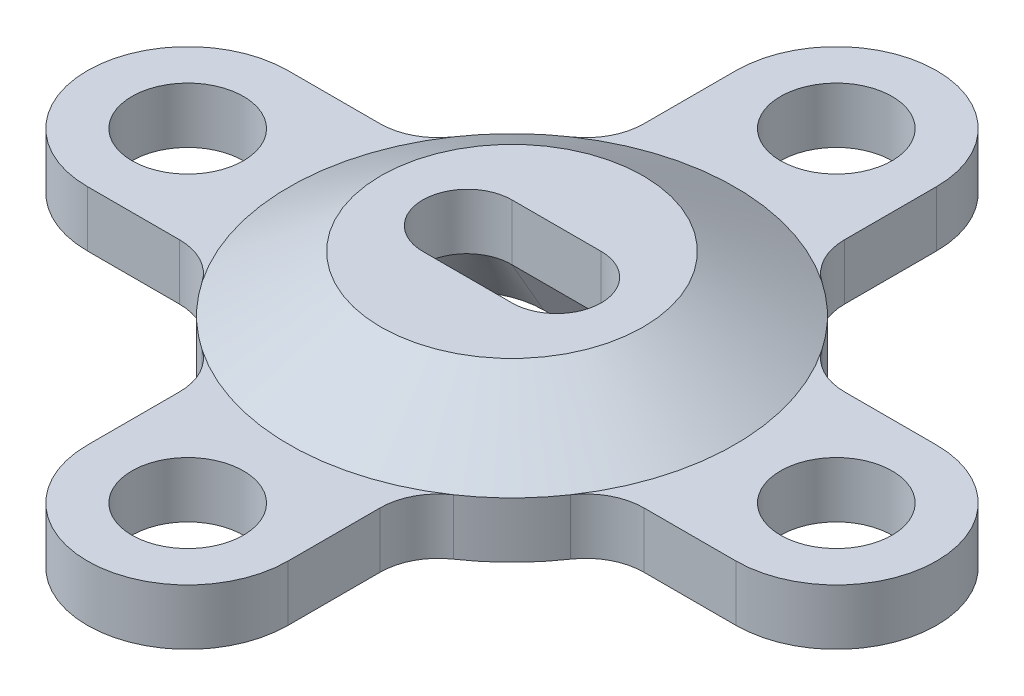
from build123d import *

# Parameters (mm, degrees)
CUT_EXTRUDE1_DEPTH  = 15.748
SKETCH3_R           = 3.175
BOSS_EXTRUDE1_DEPTH = 3.175
FILLET1_R           = 3.302
CUT_EXTRUDE2_DEPTH  = 3.175
CUT_EXTRUDE2_DRAFT  = -30


with BuildPart() as part:
    # Sketch1 → Revolve1 (revolve)
    with BuildSketch(Plane.XY, mode=Mode.PRIVATE) as revolve1_sk:
        Polygon((-12.7, 0), (-12.7, 3.175), (-7.465676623, 6.35), (0, 6.35), (0, 0), align=None)
    revolve(revolve1_sk.sketch.rotate(Axis((0, 0, 0), (0, -1, 0)), 270), axis=Axis((0, 0, 0), (0, -1, 0)))

    # Sketch2 → Cut-Extrude1 (cut)
    with BuildSketch(Plane(origin=(0, 6.35, 0), x_dir=(1, 0, 0), z_dir=(0, 1, 0))):
        with BuildLine():
            Line((-2.54, 2.54), (2.54, 2.54))
            ThreePointArc((2.54, 2.54), (5.08, 0), (2.54, -2.54))
            Line((2.54, -2.54), (-2.54, -2.54))
            ThreePointArc((-2.54, -2.54), (-5.08, 0), (-2.54, 2.54))
        make_face()
    extrude(amount=-CUT_EXTRUDE1_DEPTH, mode=Mode.SUBTRACT)

    # Sketch3 → Boss-Extrude1 (add)
    # profile 1 of 4: a face of its own
    with BuildSketch(Plane(origin=(0, 0, 0), x_dir=(1, 0, 0), z_dir=(0, 1, 0))):
        with BuildLine():
            Line((-5.715, 18.463010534), (-5.715, 7.915661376))
            Line((-5.715, 7.915661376), (5.715, 7.915661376))
            Line((5.715, 7.915661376), (5.715, 18.463010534))
            ThreePointArc((5.715, 18.463010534), (0, 24.178010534), (-5.715, 18.463010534))
        make_face()
        with Locations(Location((0, 18.463010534, 0), (0, 0, 270))):
            Circle(SKETCH3_R, mode=Mode.SUBTRACT)
    # profile 2 of 4: a face of its own
    with BuildSketch(Plane(origin=(0, 0, 0), x_dir=(1, 0, 0), z_dir=(0, 1, 0))):
        with BuildLine():
            Line((18.463010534, 5.715), (7.915661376, 5.715))
            Line((7.915661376, 5.715), (7.915661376, -5.715))
            Line((7.915661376, -5.715), (18.463010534, -5.715))
            ThreePointArc((18.463010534, -5.715), (24.178010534, 0), (18.463010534, 5.715))
        make_face()
        with Locations(Location((18.463010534, 0, 0), (0, 0, 270))):
            Circle(SKETCH3_R, mode=Mode.SUBTRACT)
    # profile 3 of 4: a face of its own
    with BuildSketch(Plane(origin=(0, 0, 0), x_dir=(1, 0, 0), z_dir=(0, 1, 0))):
        with BuildLine():
            Line((5.715, -18.463010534), (5.715, -7.915661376))
            Line((5.715, -7.915661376), (-5.715, -7.915661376))
            Line((-5.715, -7.915661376), (-5.715, -18.463010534))
            ThreePointArc((-5.715, -18.463010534), (0, -24.178010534), (5.715, -18.463010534))
        make_face()
        with Locations(Location((0, -18.463010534, 0), (0, 0, 270))):
            Circle(SKETCH3_R, mode=Mode.SUBTRACT)
    # profile 4 of 4: a face of its own
    with BuildSketch(Plane(origin=(0, 0, 0), x_dir=(1, 0, 0), z_dir=(0, 1, 0))):
        with BuildLine():
            Line((-18.463010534, -5.715), (-7.915661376, -5.715))
            Line((-7.915661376, -5.715), (-7.915661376, 5.715))
            Line((-7.915661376, 5.715), (-18.463010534, 5.715))
            ThreePointArc((-18.463010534, 5.715), (-24.178010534, 0), (-18.463010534, -5.715))
        make_face()
        with Locations(Location((-18.463010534, 0, 0), (0, 0, 270))):
            Circle(SKETCH3_R, mode=Mode.SUBTRACT)
    extrude(amount=BOSS_EXTRUDE1_DEPTH)

    # Fillet1
    fillet1_edges = [part.edges().sort_by_distance(p)[0] for p in [
        (5.715, 1.5875, -11.341462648),
        (-5.715, 1.5875, -11.341462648),
        (11.341462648, 1.5875, -5.715),
        (11.341462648, 1.5875, 5.715),
        (5.715, 1.5875, 11.341462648),
        (-5.715, 1.5875, 11.341462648),
        (-11.341462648, 1.5875, 5.715),
        (-11.341462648, 1.5875, -5.715),
    ]]
    fillet(fillet1_edges, radius=FILLET1_R)


with BuildPart() as cut_extrude2_tool:
    # Sketch5 → Cut-Extrude2 (with draft: the straight prism first)
    with BuildSketch(Plane.XZ):
        with BuildLine():
            ThreePointArc((-2.555585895, 4.360806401), (-6.916392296, 0), (-2.555585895, -4.360806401))
            Line((-2.555585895, -4.360806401), (2.555585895, -4.360806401))
            ThreePointArc((2.555585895, -4.360806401), (6.916392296, 0), (2.555585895, 4.360806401))
            Line((2.555585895, 4.360806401), (-2.555585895, 4.360806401))
        make_face()
    extrude(amount=-CUT_EXTRUDE2_DEPTH)
    # Cut-Extrude2: the draft: its side faces are tilted about the plane it starts from
    cut_extrude2_sides = [cut_extrude2_tool.faces().sort_by_distance(p)[0] for p in [
        (0, 1.5875, -4.360806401),
        (6.916392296, 1.5875, 0),
        (0, 1.5875, 4.360806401),
        (-6.916392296, 1.5875, 0),
    ]]
    draft(cut_extrude2_sides, Plane.XZ, CUT_EXTRUDE2_DRAFT)


with BuildPart() as part_1:
    add(part.part)

    # Cut-Extrude2: cut by cut_extrude2_tool
    add(cut_extrude2_tool.part, mode=Mode.SUBTRACT)


solid = part_1.part
